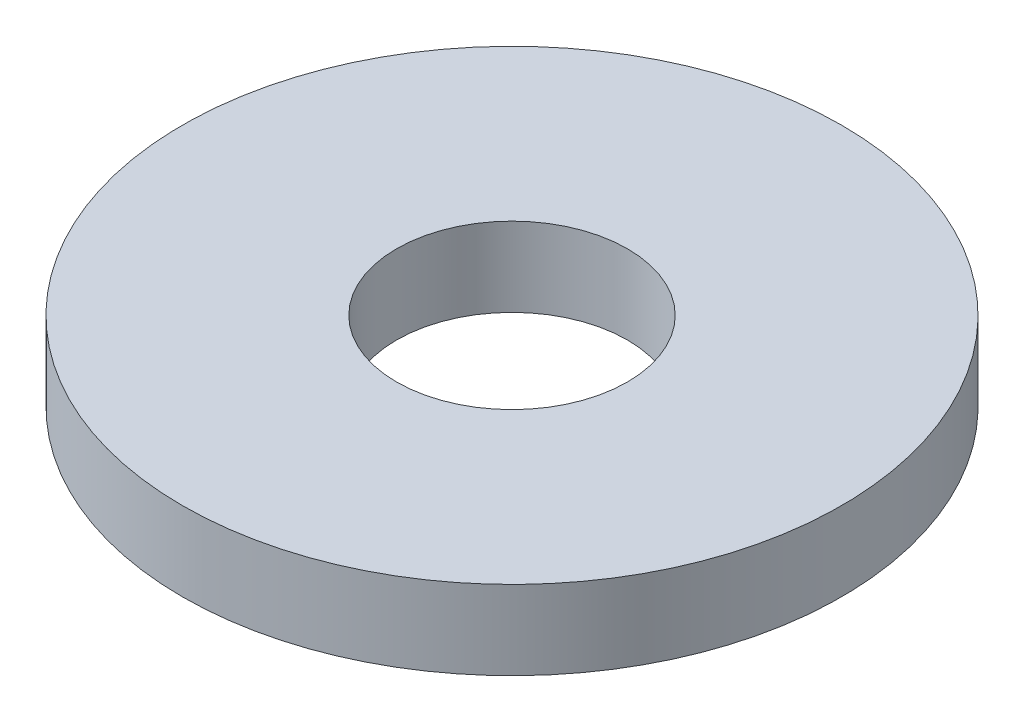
from build123d import *

# Parameters (mm, degrees)
SKETCH1_R           = 5.0038
SKETCH1_R_2         = 1.7526
BOSS_EXTRUDE1_DEPTH = 1.2


with BuildPart() as part:
    # Sketch1 → Boss-Extrude1 (new body)
    with BuildSketch(Plane(origin=(0, 0, 0), x_dir=(1, 0, 0), z_dir=(0, 1, 0))):
        with Locations(Location((0, 0, 0), (0, 0, 270))):
            Circle(SKETCH1_R)
        with Locations(Location((0, 0, 0), (0, 0, 270))):
            Circle(SKETCH1_R_2, mode=Mode.SUBTRACT)
    extrude(amount=BOSS_EXTRUDE1_DEPTH)


solid = part.part
